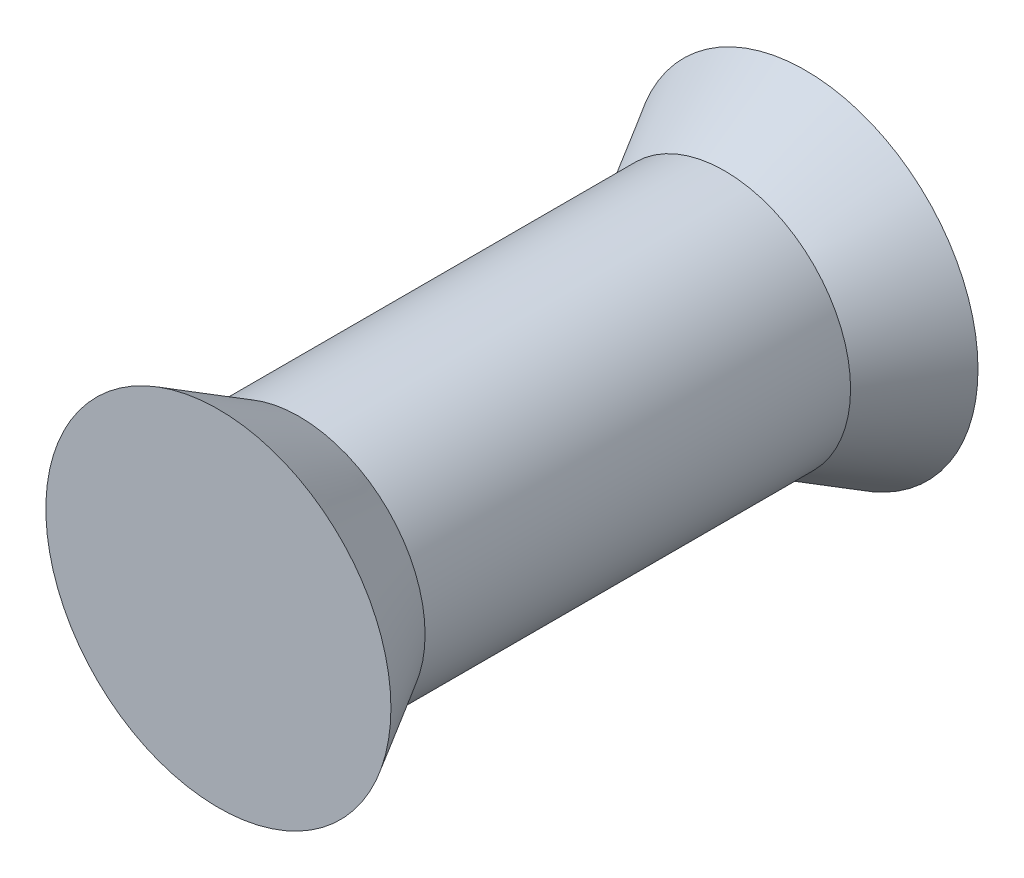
ISO-10303-21;
HEADER;
FILE_DESCRIPTION(('STEP AP214'),'2;1');
FILE_NAME('part.step','',(''),(''),'','','');
FILE_SCHEMA(('AUTOMOTIVE_DESIGN { 1 0 10303 214 1 1 1 1 }'));
ENDSEC;
DATA;
#1=APPLICATION_CONTEXT('core data for automotive mechanical design processes');
#2=APPLICATION_PROTOCOL_DEFINITION('international standard','automotive_design',2000,#1);
#3=PRODUCT_CONTEXT('',#1,'mechanical');
#4=PRODUCT('Part','Part','',(#3));
#5=PRODUCT_RELATED_PRODUCT_CATEGORY('part','',(#4));
#6=PRODUCT_DEFINITION_FORMATION('','',#4);
#7=PRODUCT_DEFINITION_CONTEXT('part definition',#1,'design');
#8=PRODUCT_DEFINITION('design','',#6,#7);
#9=PRODUCT_DEFINITION_SHAPE('','',#8);
#10=(LENGTH_UNIT() NAMED_UNIT(*) SI_UNIT(.MILLI.,.METRE.));
#11=(NAMED_UNIT(*) PLANE_ANGLE_UNIT() SI_UNIT($,.RADIAN.));
#12=(NAMED_UNIT(*) SI_UNIT($,.STERADIAN.) SOLID_ANGLE_UNIT());
#13=UNCERTAINTY_MEASURE_WITH_UNIT(LENGTH_MEASURE(1.E-05),#10,'distance_accuracy_value','');
#14=(GEOMETRIC_REPRESENTATION_CONTEXT(3) GLOBAL_UNCERTAINTY_ASSIGNED_CONTEXT((#13)) GLOBAL_UNIT_ASSIGNED_CONTEXT((#10,
#11,#12)) REPRESENTATION_CONTEXT('',''));
#15=CARTESIAN_POINT('',(0.,0.,0.));
#16=DIRECTION('',(0.,0.,1.));
#17=DIRECTION('',(1.,0.,0.));
#18=AXIS2_PLACEMENT_3D('',#15,#16,#17);
#19=CARTESIAN_POINT('',(0.,0.,-11.0744));
#20=DIRECTION('',(0.,0.,1.));
#21=DIRECTION('',(1.,0.,0.));
#22=AXIS2_PLACEMENT_3D('',#19,#20,#21);
#23=PLANE('',#22);
#24=CARTESIAN_POINT('',(0.,0.,-11.0744));
#25=DIRECTION('',(0.,0.,1.));
#26=DIRECTION('',(1.,0.,0.));
#27=AXIS2_PLACEMENT_3D('',#24,#25,#26);
#28=CIRCLE('',#27,3.25478181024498);
#29=CARTESIAN_POINT('',(3.25478181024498,0.,-11.0744));
#30=VERTEX_POINT('',#29);
#31=EDGE_CURVE('E10',#30,#30,#28,.T.);
#32=ORIENTED_EDGE('',*,*,#31,.F.);
#33=EDGE_LOOP('',(#32));
#34=FACE_BOUND('',#33,.T.);
#35=ADVANCED_FACE('F35',(#34),#23,.F.);
#36=CARTESIAN_POINT('',(0.,0.,-11.0744));
#37=DIRECTION('',(0.,0.,-1.));
#38=DIRECTION('',(-1.,0.,0.));
#39=AXIS2_PLACEMENT_3D('',#36,#37,#38);
#40=CONICAL_SURFACE('',#39,3.25478181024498,0.523598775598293);
#41=CARTESIAN_POINT('',(0.,0.,-9.5504));
#42=DIRECTION('',(0.,0.,1.));
#43=DIRECTION('',(1.,0.,0.));
#44=AXIS2_PLACEMENT_3D('',#41,#42,#43);
#45=CIRCLE('',#44,2.3749);
#46=CARTESIAN_POINT('',(2.3749,0.,-9.5504));
#47=VERTEX_POINT('',#46);
#48=EDGE_CURVE('E41',#47,#47,#45,.T.);
#49=ORIENTED_EDGE('',*,*,#48,.F.);
#50=EDGE_LOOP('',(#49));
#51=FACE_BOUND('',#50,.T.);
#52=ORIENTED_EDGE('',*,*,#31,.T.);
#53=EDGE_LOOP('',(#52));
#54=FACE_BOUND('',#53,.T.);
#55=ADVANCED_FACE('F65',(#51,#54),#40,.T.);
#56=CARTESIAN_POINT('',(0.,0.,0.));
#57=DIRECTION('',(0.,0.,1.));
#58=DIRECTION('',(1.,0.,0.));
#59=AXIS2_PLACEMENT_3D('',#56,#57,#58);
#60=CYLINDRICAL_SURFACE('',#59,2.3749);
#61=CARTESIAN_POINT('',(0.,0.,-1.524));
#62=DIRECTION('',(0.,0.,1.));
#63=DIRECTION('',(1.,0.,0.));
#64=AXIS2_PLACEMENT_3D('',#61,#62,#63);
#65=CIRCLE('',#64,2.3749);
#66=CARTESIAN_POINT('',(2.3749,0.,-1.524));
#67=VERTEX_POINT('',#66);
#68=EDGE_CURVE('E45',#67,#67,#65,.T.);
#69=ORIENTED_EDGE('',*,*,#68,.F.);
#70=EDGE_LOOP('',(#69));
#71=FACE_BOUND('',#70,.T.);
#72=ORIENTED_EDGE('',*,*,#48,.T.);
#73=EDGE_LOOP('',(#72));
#74=FACE_BOUND('',#73,.T.);
#75=ADVANCED_FACE('F60',(#71,#74),#60,.T.);
#76=CARTESIAN_POINT('',(0.,0.,-1.524));
#77=DIRECTION('',(0.,0.,1.));
#78=DIRECTION('',(1.,0.,0.));
#79=AXIS2_PLACEMENT_3D('',#76,#77,#78);
#80=CONICAL_SURFACE('',#79,2.3749,0.523598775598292);
#81=CARTESIAN_POINT('',(0.,0.,0.));
#82=DIRECTION('',(0.,0.,1.));
#83=DIRECTION('',(1.,0.,0.));
#84=AXIS2_PLACEMENT_3D('',#81,#82,#83);
#85=CIRCLE('',#84,3.25478181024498);
#86=CARTESIAN_POINT('',(3.25478181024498,0.,0.));
#87=VERTEX_POINT('',#86);
#88=EDGE_CURVE('E49',#87,#87,#85,.T.);
#89=ORIENTED_EDGE('',*,*,#88,.F.);
#90=EDGE_LOOP('',(#89));
#91=FACE_BOUND('',#90,.T.);
#92=ORIENTED_EDGE('',*,*,#68,.T.);
#93=EDGE_LOOP('',(#92));
#94=FACE_BOUND('',#93,.T.);
#95=ADVANCED_FACE('F57',(#91,#94),#80,.T.);
#96=CARTESIAN_POINT('',(0.,3.25478181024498,0.));
#97=DIRECTION('',(0.,0.,-1.));
#98=DIRECTION('',(-1.,0.,0.));
#99=AXIS2_PLACEMENT_3D('',#96,#97,#98);
#100=PLANE('',#99);
#101=ORIENTED_EDGE('',*,*,#88,.T.);
#102=EDGE_LOOP('',(#101));
#103=FACE_BOUND('',#102,.T.);
#104=ADVANCED_FACE('F55',(#103),#100,.F.);
#105=CLOSED_SHELL('',(#35,#55,#75,#95,#104));
#106=MANIFOLD_SOLID_BREP('B2',#105);
#107=ADVANCED_BREP_SHAPE_REPRESENTATION('',(#18,#106),#14);
#108=SHAPE_DEFINITION_REPRESENTATION(#9,#107);
ENDSEC;
END-ISO-10303-21;
